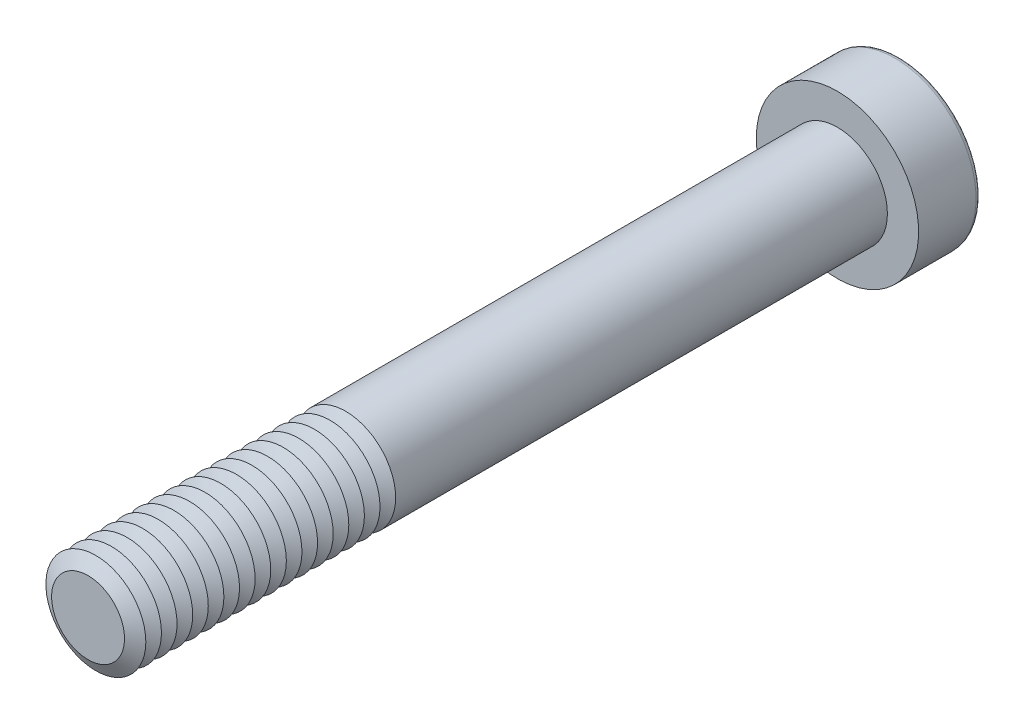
from build123d import *

# Parameters (mm, degrees)
SKETCH1_R           = 4
BOSS_EXTRUDE1_DEPTH = 60
SKETCH2_R           = 6.5
BOSS_EXTRUDE2_DEPTH = 5
CUT_EXTRUDE1_DEPTH  = 3.75
FILLET1_R           = 0.4
LPATTERN1_COUNT     = 17
LPATTERN1_PITCH     = 1.25


with BuildPart() as part:
    # Sketch1 → Boss-Extrude1 (new body)
    with BuildSketch(Plane.XY):
        Circle(SKETCH1_R)
    extrude(amount=BOSS_EXTRUDE1_DEPTH)

    # Sketch2 → Boss-Extrude2 (add)
    with BuildSketch(Plane(origin=(0, 0, 0), x_dir=(-1, 0, 0), z_dir=(0, 0, -1))):
        Circle(SKETCH2_R)
    extrude(amount=BOSS_EXTRUDE2_DEPTH)

    # Sketch3 → Cut-Extrude1 (cut)
    with BuildSketch(Plane(origin=(0, 0, -5), x_dir=(-1, 0, 0), z_dir=(0, 0, -1))):
        Polygon((-1.443375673, 2.5), (-2.886751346, 0), (-1.443375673, -2.5), (1.443375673, -2.5), (2.886751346, 0), (1.443375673, 2.5), align=None)
    extrude(amount=-CUT_EXTRUDE1_DEPTH, mode=Mode.SUBTRACT)

    # Fillet1
    fillet1_edges = [part.edges().sort_by_distance(p)[0] for p in [
        (6.5, 0, -5),
    ]]
    fillet(fillet1_edges, radius=FILLET1_R)

    # Cut-Extrude2 cone 1 section (on through the dimple's axis) → Cut-Extrude2 (revolve, cut)
    with BuildSketch(Plane(origin=(0, 0, -1.25), x_dir=(0, 1, 0), z_dir=(1, 0, 0))):
        Polygon((0, 0), (2.5, 0), (0, 1.443375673), align=None)
    revolve(axis=Axis((0, 0, -1.25), (0, 0, 1)), mode=Mode.SUBTRACT)

    # Cut-Extrude3 cone 1 section (on through the dimple's axis) → Cut-Extrude3 (revolve, cut)
    with BuildSketch(Plane(origin=(0, 0, -5), x_dir=(0, 1, 0), z_dir=(1, 0, 0))):
        Polygon((0, 0), (2.886751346, 0), (0, 0.773502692), align=None)
    revolve(axis=Axis((0, 0, -5), (0, 0, 1)), mode=Mode.SUBTRACT)

    # Sketch7 → Cut-Revolve1 (revolve, cut)
    with BuildSketch(Plane(origin=(0, 0, 0), x_dir=(0, 0, -1), z_dir=(1, 0, 0)), mode=Mode.PRIVATE) as cut_revolve1_sk:
        Polygon((-60, 2.917468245), (-59.375, 4), (-60.625, 4), align=None)
    cut_revolve1 = revolve(cut_revolve1_sk.sketch.rotate(Axis((0, 0, 60), (0, 0, -1)), 90), axis=Axis((0, 0, 60), (0, 0, -1)), mode=Mode.SUBTRACT)

    # LPattern1: Cut-Revolve1 ×17
    with Locations(*[(0, 0, -i * LPATTERN1_PITCH) for i in range(1, LPATTERN1_COUNT)]):
        add(cut_revolve1, mode=Mode.SUBTRACT)


solid = part.part
